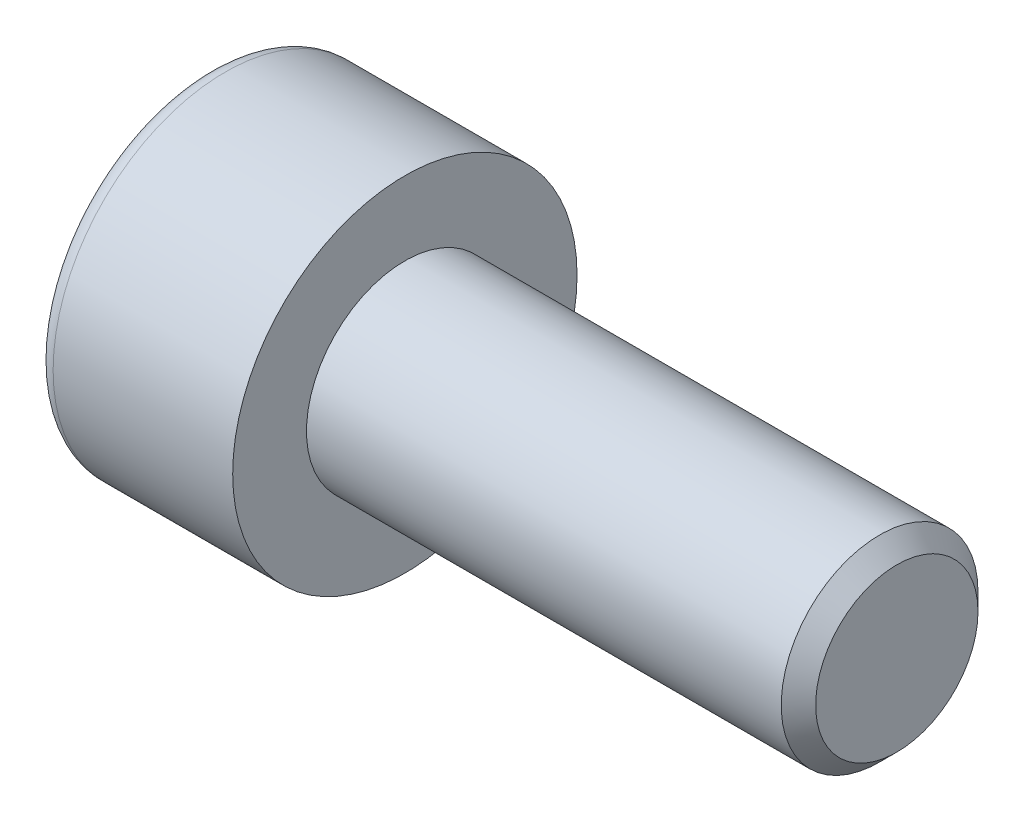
from build123d import *

# Parameters (mm, degrees)
CHANFREIN_TIGE_SIZE     = 0.35
CONG_TETE_R             = 0.35
ENL_V_MAT_EXTRU_1_DEPTH = 2.4


with BuildPart() as part:
    # Esquisse1 → Base-R_volution (revolve)
    with BuildSketch(Plane.XY, mode=Mode.PRIVATE) as base_r_volution_sk:
        Polygon((0, 2), (0, 3.5), (-4, 3.5), (-4, 0), (10, 0), (10, 2), align=None)
    revolve(base_r_volution_sk.sketch.rotate(Axis((12.501307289, 0, 0), (-1, 0, 0)), 90), axis=Axis((12.501307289, 0, 0), (-1, 0, 0)))

    # Chanfrein tige
    chanfrein_tige_edges = [part.edges().sort_by_distance(p)[0] for p in [
        (10, 0, 2),
    ]]
    chamfer(chanfrein_tige_edges, length=CHANFREIN_TIGE_SIZE)

    # Cong_ tete
    cong_tete_edges = [part.edges().sort_by_distance(p)[0] for p in [
        (-4, 0, 3.5),
    ]]
    fillet(cong_tete_edges, radius=CONG_TETE_R)

    # Esquisse2 → Enl_v. mat.-Extru.1 (cut)
    with BuildSketch(Plane.ZY.offset(4)):
        Polygon((1.732050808, 0), (0.866025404, 1.5), (-0.866025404, 1.5), (-1.732050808, 0), (-0.866025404, -1.5), (0.866025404, -1.5), align=None)
    extrude(amount=-ENL_V_MAT_EXTRU_1_DEPTH, mode=Mode.SUBTRACT)


solid = part.part
